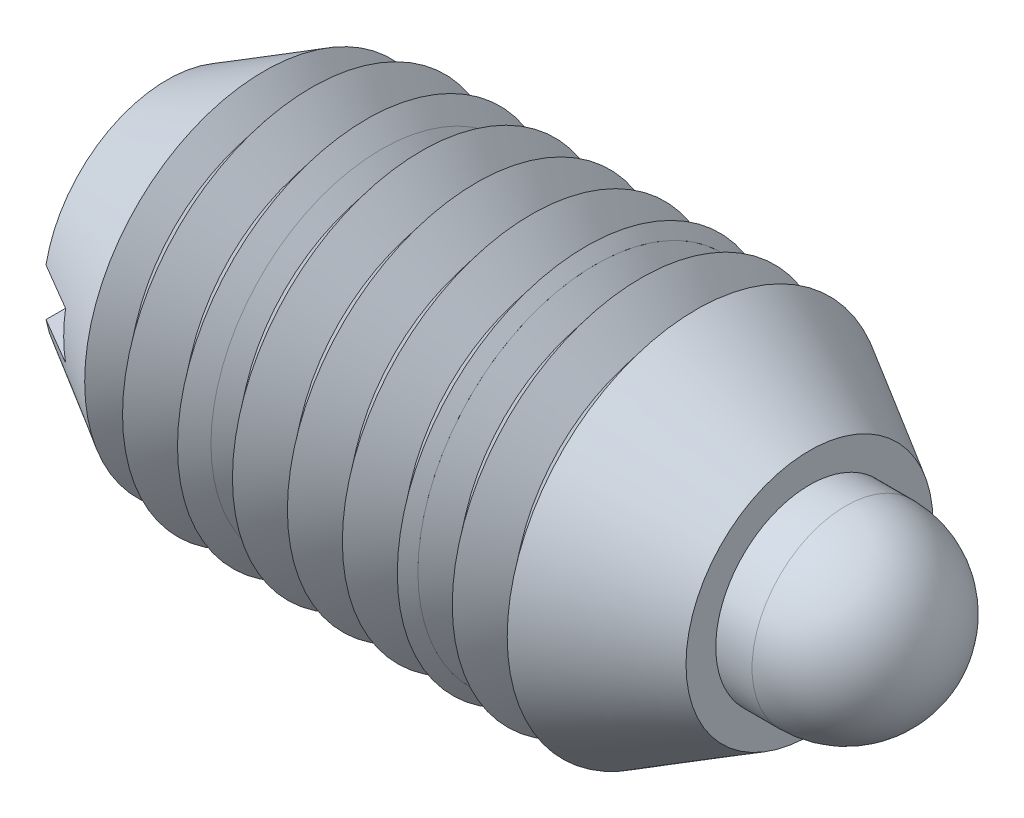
ISO-10303-21;
HEADER;
FILE_DESCRIPTION(('STEP AP214'),'2;1');
FILE_NAME('part.step','',(''),(''),'','','');
FILE_SCHEMA(('AUTOMOTIVE_DESIGN { 1 0 10303 214 1 1 1 1 }'));
ENDSEC;
DATA;
#1=APPLICATION_CONTEXT('core data for automotive mechanical design processes');
#2=APPLICATION_PROTOCOL_DEFINITION('international standard','automotive_design',2000,#1);
#3=PRODUCT_CONTEXT('',#1,'mechanical');
#4=PRODUCT('Part','Part','',(#3));
#5=PRODUCT_RELATED_PRODUCT_CATEGORY('part','',(#4));
#6=PRODUCT_DEFINITION_FORMATION('','',#4);
#7=PRODUCT_DEFINITION_CONTEXT('part definition',#1,'design');
#8=PRODUCT_DEFINITION('design','',#6,#7);
#9=PRODUCT_DEFINITION_SHAPE('','',#8);
#10=(LENGTH_UNIT() NAMED_UNIT(*) SI_UNIT(.MILLI.,.METRE.));
#11=(NAMED_UNIT(*) PLANE_ANGLE_UNIT() SI_UNIT($,.RADIAN.));
#12=(NAMED_UNIT(*) SI_UNIT($,.STERADIAN.) SOLID_ANGLE_UNIT());
#13=UNCERTAINTY_MEASURE_WITH_UNIT(LENGTH_MEASURE(1.E-05),#10,'distance_accuracy_value','');
#14=(GEOMETRIC_REPRESENTATION_CONTEXT(3) GLOBAL_UNCERTAINTY_ASSIGNED_CONTEXT((#13)) GLOBAL_UNIT_ASSIGNED_CONTEXT((#10,
#11,#12)) REPRESENTATION_CONTEXT('',''));
#15=CARTESIAN_POINT('',(0.,0.,0.));
#16=DIRECTION('',(0.,0.,1.));
#17=DIRECTION('',(1.,0.,0.));
#18=AXIS2_PLACEMENT_3D('',#15,#16,#17);
#19=CARTESIAN_POINT('',(17.9324,0.,0.));
#20=DIRECTION('',(-1.,0.,0.));
#21=DIRECTION('',(0.,-0.719424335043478,-0.694570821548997));
#22=AXIS2_PLACEMENT_3D('',#19,#20,#21);
#23=PLANE('',#22);
#24=CARTESIAN_POINT('',(17.9324,0.,0.));
#25=DIRECTION('',(1.,0.,0.));
#26=DIRECTION('',(0.,0.719424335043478,0.694570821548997));
#27=AXIS2_PLACEMENT_3D('',#24,#25,#26);
#28=CIRCLE('',#27,3.937);
#29=CARTESIAN_POINT('',(17.9324,2.83237360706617,2.7345253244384));
#30=VERTEX_POINT('',#29);
#31=EDGE_CURVE('P0_E10',#30,#30,#28,.T.);
#32=ORIENTED_EDGE('',*,*,#31,.F.);
#33=EDGE_LOOP('',(#32));
#34=FACE_BOUND('',#33,.T.);
#35=ADVANCED_FACE('P0_F14',(#34),#23,.T.);
#36=CARTESIAN_POINT('',(18.7198,0.,0.));
#37=DIRECTION('',(1.,0.,0.));
#38=DIRECTION('',(0.,0.719424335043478,0.694570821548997));
#39=AXIS2_PLACEMENT_3D('',#36,#37,#38);
#40=CONICAL_SURFACE('',#39,4.7244,0.78539816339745);
#41=ORIENTED_EDGE('',*,*,#31,.T.);
#42=EDGE_LOOP('',(#41));
#43=FACE_BOUND('',#42,.T.);
#44=CARTESIAN_POINT('',(18.7198,0.,0.));
#45=DIRECTION('',(1.,0.,0.));
#46=DIRECTION('',(0.,0.719424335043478,0.694570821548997));
#47=AXIS2_PLACEMENT_3D('',#44,#45,#46);
#48=CIRCLE('',#47,4.7244);
#49=CARTESIAN_POINT('',(18.7198,3.39884832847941,3.28143038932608));
#50=VERTEX_POINT('',#49);
#51=EDGE_CURVE('P0_E20',#50,#50,#48,.T.);
#52=ORIENTED_EDGE('',*,*,#51,.F.);
#53=EDGE_LOOP('',(#52));
#54=FACE_BOUND('',#53,.T.);
#55=ADVANCED_FACE('P0_F54',(#43,#54),#40,.T.);
#56=CARTESIAN_POINT('',(32.4485,0.,0.));
#57=DIRECTION('',(1.,0.,0.));
#58=DIRECTION('',(0.,0.719424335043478,0.694570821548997));
#59=AXIS2_PLACEMENT_3D('',#56,#57,#58);
#60=CYLINDRICAL_SURFACE('',#59,4.7244);
#61=ORIENTED_EDGE('',*,*,#51,.T.);
#62=EDGE_LOOP('',(#61));
#63=FACE_BOUND('',#62,.T.);
#64=CARTESIAN_POINT('',(24.4425831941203,0.,0.));
#65=DIRECTION('',(1.,0.,0.));
#66=DIRECTION('',(0.,0.719424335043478,0.694570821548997));
#67=AXIS2_PLACEMENT_3D('',#64,#65,#66);
#68=CIRCLE('',#67,4.7244);
#69=CARTESIAN_POINT('',(24.4425831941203,3.39884832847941,3.28143038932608));
#70=VERTEX_POINT('',#69);
#71=EDGE_CURVE('P0_E24',#70,#70,#68,.T.);
#72=ORIENTED_EDGE('',*,*,#71,.F.);
#73=EDGE_LOOP('',(#72));
#74=FACE_BOUND('',#73,.T.);
#75=ADVANCED_FACE('P0_F50',(#63,#74),#60,.T.);
#76=CARTESIAN_POINT('',(25.8064,0.,0.));
#77=DIRECTION('',(-1.,0.,0.));
#78=DIRECTION('',(0.,-0.719424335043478,-0.694570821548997));
#79=AXIS2_PLACEMENT_3D('',#76,#77,#78);
#80=CONICAL_SURFACE('',#79,3.937,0.523598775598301);
#81=ORIENTED_EDGE('',*,*,#71,.T.);
#82=EDGE_LOOP('',(#81));
#83=FACE_BOUND('',#82,.T.);
#84=CARTESIAN_POINT('',(25.8064,0.,0.));
#85=DIRECTION('',(1.,0.,0.));
#86=DIRECTION('',(0.,0.719424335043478,0.694570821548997));
#87=AXIS2_PLACEMENT_3D('',#84,#85,#86);
#88=CIRCLE('',#87,3.937);
#89=CARTESIAN_POINT('',(25.8064,2.83237360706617,2.7345253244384));
#90=VERTEX_POINT('',#89);
#91=EDGE_CURVE('P0_E28',#90,#90,#88,.T.);
#92=ORIENTED_EDGE('',*,*,#91,.F.);
#93=EDGE_LOOP('',(#92));
#94=FACE_BOUND('',#93,.T.);
#95=ADVANCED_FACE('P0_F41',(#83,#94),#80,.T.);
#96=CARTESIAN_POINT('',(32.4485,0.,0.));
#97=DIRECTION('',(1.,0.,0.));
#98=DIRECTION('',(0.,0.719424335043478,0.694570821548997));
#99=AXIS2_PLACEMENT_3D('',#96,#97,#98);
#100=CYLINDRICAL_SURFACE('',#99,3.937);
#101=ORIENTED_EDGE('',*,*,#91,.T.);
#102=EDGE_LOOP('',(#101));
#103=FACE_BOUND('',#102,.T.);
#104=CARTESIAN_POINT('',(28.5115,0.,0.));
#105=DIRECTION('',(1.,0.,0.));
#106=DIRECTION('',(0.,0.719424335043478,0.694570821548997));
#107=AXIS2_PLACEMENT_3D('',#104,#105,#106);
#108=CIRCLE('',#107,3.937);
#109=CARTESIAN_POINT('',(28.5115,2.83237360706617,2.7345253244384));
#110=VERTEX_POINT('',#109);
#111=EDGE_CURVE('P0_E33',#110,#110,#108,.T.);
#112=ORIENTED_EDGE('',*,*,#111,.F.);
#113=EDGE_LOOP('',(#112));
#114=FACE_BOUND('',#113,.T.);
#115=ADVANCED_FACE('P0_F39',(#103,#114),#100,.T.);
#116=CARTESIAN_POINT('',(28.5115,0.,0.));
#117=DIRECTION('',(1.,0.,0.));
#118=DIRECTION('',(0.,0.719424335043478,0.694570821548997));
#119=AXIS2_PLACEMENT_3D('',#116,#117,#118);
#120=SPHERICAL_SURFACE('',#119,3.937);
#121=ORIENTED_EDGE('',*,*,#111,.T.);
#122=EDGE_LOOP('',(#121));
#123=FACE_BOUND('',#122,.T.);
#124=ADVANCED_FACE('P0_F37',(#123),#120,.T.);
#125=CLOSED_SHELL('',(#35,#55,#75,#95,#115,#124));
#126=MANIFOLD_SOLID_BREP('P0_B1',#125);
#127=CARTESIAN_POINT('',(8.99583333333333,15.875,-7.9375));
#128=DIRECTION('',(-1.,0.,0.));
#129=DIRECTION('',(0.,-1.,0.));
#130=AXIS2_PLACEMENT_3D('',#127,#128,#129);
#131=PLANE('',#130);
#132=CARTESIAN_POINT('',(8.99583333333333,0.,0.));
#133=DIRECTION('',(-1.,0.,0.));
#134=DIRECTION('',(0.,-1.,0.));
#135=AXIS2_PLACEMENT_3D('',#132,#133,#134);
#136=CIRCLE('',#135,7.15640214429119);
#137=CARTESIAN_POINT('',(8.99583333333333,-7.15640214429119,0.));
#138=VERTEX_POINT('',#137);
#139=EDGE_CURVE('P1_E31',#138,#138,#136,.F.);
#140=ORIENTED_EDGE('',*,*,#139,.F.);
#141=EDGE_LOOP('',(#140));
#142=FACE_BOUND('',#141,.T.);
#143=CARTESIAN_POINT('',(8.99583333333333,0.,0.));
#144=DIRECTION('',(1.,0.,0.));
#145=DIRECTION('',(0.,0.,-1.));
#146=AXIS2_PLACEMENT_3D('',#143,#144,#145);
#147=CIRCLE('',#146,4.7498);
#148=CARTESIAN_POINT('',(8.99583333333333,0.,-4.7498));
#149=VERTEX_POINT('',#148);
#150=EDGE_CURVE('P1_E47',#149,#149,#147,.T.);
#151=ORIENTED_EDGE('',*,*,#150,.T.);
#152=EDGE_LOOP('',(#151));
#153=FACE_BOUND('',#152,.T.);
#154=ADVANCED_FACE('P1_F14',(#142,#153),#131,.T.);
#155=CARTESIAN_POINT('',(17.9916666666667,15.875,-7.9375));
#156=DIRECTION('',(1.,0.,0.));
#157=DIRECTION('',(0.,1.,0.));
#158=AXIS2_PLACEMENT_3D('',#155,#156,#157);
#159=PLANE('',#158);
#160=CARTESIAN_POINT('',(17.9916666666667,0.,0.));
#161=DIRECTION('',(1.,0.,0.));
#162=DIRECTION('',(0.,1.,0.));
#163=AXIS2_PLACEMENT_3D('',#160,#161,#162);
#164=CIRCLE('',#163,7.45682439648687);
#165=CARTESIAN_POINT('',(17.9916666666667,7.45682439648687,0.));
#166=VERTEX_POINT('',#165);
#167=EDGE_CURVE('P1_E33',#166,#166,#164,.F.);
#168=ORIENTED_EDGE('',*,*,#167,.F.);
#169=EDGE_LOOP('',(#168));
#170=FACE_BOUND('',#169,.T.);
#171=CARTESIAN_POINT('',(17.9916666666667,0.,0.));
#172=DIRECTION('',(1.,0.,0.));
#173=DIRECTION('',(0.,1.,0.));
#174=AXIS2_PLACEMENT_3D('',#171,#172,#173);
#175=CIRCLE('',#174,4.7498);
#176=CARTESIAN_POINT('',(17.9916666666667,4.7498,0.));
#177=VERTEX_POINT('',#176);
#178=EDGE_CURVE('P1_E18',#177,#177,#175,.F.);
#179=ORIENTED_EDGE('',*,*,#178,.T.);
#180=EDGE_LOOP('',(#179));
#181=FACE_BOUND('',#180,.T.);
#182=ADVANCED_FACE('P1_F65',(#170,#181),#159,.T.);
#183=CARTESIAN_POINT('',(14.1431818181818,0.,0.));
#184=DIRECTION('',(1.,0.,0.));
#185=DIRECTION('',(0.,0.,-1.));
#186=AXIS2_PLACEMENT_3D('',#183,#184,#185);
#187=CONICAL_SURFACE('',#186,6.49547318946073,0.895664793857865);
#188=CARTESIAN_POINT('',(15.2977272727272,0.,0.));
#189=DIRECTION('',(-1.,0.,0.));
#190=DIRECTION('',(0.,0.,1.));
#191=AXIS2_PLACEMENT_3D('',#188,#189,#190);
#192=CIRCLE('',#191,7.9375);
#193=CARTESIAN_POINT('',(15.2977272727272,0.,7.9375));
#194=VERTEX_POINT('',#193);
#195=EDGE_CURVE('P1_E54',#194,#194,#192,.T.);
#196=ORIENTED_EDGE('',*,*,#195,.T.);
#197=EDGE_LOOP('',(#196));
#198=FACE_BOUND('',#197,.T.);
#199=CARTESIAN_POINT('',(14.1431818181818,0.,0.));
#200=DIRECTION('',(-1.,0.,0.));
#201=DIRECTION('',(0.,0.,1.));
#202=AXIS2_PLACEMENT_3D('',#199,#200,#201);
#203=CIRCLE('',#202,6.49547318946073);
#204=CARTESIAN_POINT('',(14.1431818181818,0.,6.49547318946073));
#205=VERTEX_POINT('',#204);
#206=EDGE_CURVE('P1_E27',#205,#205,#203,.T.);
#207=ORIENTED_EDGE('',*,*,#206,.F.);
#208=EDGE_LOOP('',(#207));
#209=FACE_BOUND('',#208,.T.);
#210=ADVANCED_FACE('P1_F62',(#198,#209),#187,.T.);
#211=CARTESIAN_POINT('',(15.2977272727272,0.,0.));
#212=DIRECTION('',(-1.,0.,0.));
#213=DIRECTION('',(0.,0.,1.));
#214=AXIS2_PLACEMENT_3D('',#211,#212,#213);
#215=CONICAL_SURFACE('',#214,7.9375,0.895664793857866);
#216=CARTESIAN_POINT('',(16.4522727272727,0.,0.));
#217=DIRECTION('',(-1.,0.,0.));
#218=DIRECTION('',(0.,0.,1.));
#219=AXIS2_PLACEMENT_3D('',#216,#217,#218);
#220=CIRCLE('',#219,6.49547318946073);
#221=CARTESIAN_POINT('',(16.4522727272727,0.,6.49547318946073));
#222=VERTEX_POINT('',#221);
#223=EDGE_CURVE('P1_E10',#222,#222,#220,.T.);
#224=ORIENTED_EDGE('',*,*,#223,.T.);
#225=EDGE_LOOP('',(#224));
#226=FACE_BOUND('',#225,.T.);
#227=ORIENTED_EDGE('',*,*,#195,.F.);
#228=EDGE_LOOP('',(#227));
#229=FACE_BOUND('',#228,.T.);
#230=ADVANCED_FACE('P1_F64',(#226,#229),#215,.T.);
#231=CARTESIAN_POINT('',(16.4522727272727,0.,0.));
#232=DIRECTION('',(1.,0.,0.));
#233=DIRECTION('',(0.,0.,-1.));
#234=AXIS2_PLACEMENT_3D('',#231,#232,#233);
#235=CONICAL_SURFACE('',#234,6.49547318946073,0.895664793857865);
#236=CARTESIAN_POINT('',(17.6068181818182,0.,0.));
#237=DIRECTION('',(-1.,0.,0.));
#238=DIRECTION('',(0.,0.,1.));
#239=AXIS2_PLACEMENT_3D('',#236,#237,#238);
#240=CIRCLE('',#239,7.9375);
#241=CARTESIAN_POINT('',(17.6068181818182,0.,7.9375));
#242=VERTEX_POINT('',#241);
#243=EDGE_CURVE('P1_E22',#242,#242,#240,.T.);
#244=ORIENTED_EDGE('',*,*,#243,.T.);
#245=EDGE_LOOP('',(#244));
#246=FACE_BOUND('',#245,.T.);
#247=ORIENTED_EDGE('',*,*,#223,.F.);
#248=EDGE_LOOP('',(#247));
#249=FACE_BOUND('',#248,.T.);
#250=ADVANCED_FACE('P1_F73',(#246,#249),#235,.T.);
#251=CARTESIAN_POINT('',(17.6068181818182,0.,0.));
#252=DIRECTION('',(-1.,0.,0.));
#253=DIRECTION('',(0.,0.,1.));
#254=AXIS2_PLACEMENT_3D('',#251,#252,#253);
#255=CONICAL_SURFACE('',#254,7.9375,0.895664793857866);
#256=ORIENTED_EDGE('',*,*,#243,.F.);
#257=EDGE_LOOP('',(#256));
#258=FACE_BOUND('',#257,.T.);
#259=ORIENTED_EDGE('',*,*,#167,.T.);
#260=EDGE_LOOP('',(#259));
#261=FACE_BOUND('',#260,.T.);
#262=ADVANCED_FACE('P1_F16',(#258,#261),#255,.T.);
#263=CARTESIAN_POINT('',(12.9886363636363,0.,0.));
#264=DIRECTION('',(-1.,0.,0.));
#265=DIRECTION('',(0.,0.,1.));
#266=AXIS2_PLACEMENT_3D('',#263,#264,#265);
#267=CONICAL_SURFACE('',#266,7.9375,0.895664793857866);
#268=ORIENTED_EDGE('',*,*,#206,.T.);
#269=EDGE_LOOP('',(#268));
#270=FACE_BOUND('',#269,.T.);
#271=CARTESIAN_POINT('',(12.9886363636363,0.,0.));
#272=DIRECTION('',(-1.,0.,0.));
#273=DIRECTION('',(0.,0.,1.));
#274=AXIS2_PLACEMENT_3D('',#271,#272,#273);
#275=CIRCLE('',#274,7.9375);
#276=CARTESIAN_POINT('',(12.9886363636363,0.,7.9375));
#277=VERTEX_POINT('',#276);
#278=EDGE_CURVE('P1_E44',#277,#277,#275,.T.);
#279=ORIENTED_EDGE('',*,*,#278,.F.);
#280=EDGE_LOOP('',(#279));
#281=FACE_BOUND('',#280,.T.);
#282=ADVANCED_FACE('P1_F59',(#270,#281),#267,.T.);
#283=CARTESIAN_POINT('',(11.8340909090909,0.,0.));
#284=DIRECTION('',(1.,0.,0.));
#285=DIRECTION('',(0.,0.,-1.));
#286=AXIS2_PLACEMENT_3D('',#283,#284,#285);
#287=CONICAL_SURFACE('',#286,6.49547318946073,0.895664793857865);
#288=ORIENTED_EDGE('',*,*,#278,.T.);
#289=EDGE_LOOP('',(#288));
#290=FACE_BOUND('',#289,.T.);
#291=CARTESIAN_POINT('',(11.8340909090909,0.,0.));
#292=DIRECTION('',(-1.,0.,0.));
#293=DIRECTION('',(0.,0.,1.));
#294=AXIS2_PLACEMENT_3D('',#291,#292,#293);
#295=CIRCLE('',#294,6.49547318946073);
#296=CARTESIAN_POINT('',(11.8340909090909,0.,6.49547318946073));
#297=VERTEX_POINT('',#296);
#298=EDGE_CURVE('P1_E51',#297,#297,#295,.T.);
#299=ORIENTED_EDGE('',*,*,#298,.F.);
#300=EDGE_LOOP('',(#299));
#301=FACE_BOUND('',#300,.T.);
#302=ADVANCED_FACE('P1_F98',(#290,#301),#287,.T.);
#303=CARTESIAN_POINT('',(10.6795454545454,0.,0.));
#304=DIRECTION('',(-1.,0.,0.));
#305=DIRECTION('',(0.,0.,1.));
#306=AXIS2_PLACEMENT_3D('',#303,#304,#305);
#307=CONICAL_SURFACE('',#306,7.9375,0.895664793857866);
#308=ORIENTED_EDGE('',*,*,#298,.T.);
#309=EDGE_LOOP('',(#308));
#310=FACE_BOUND('',#309,.T.);
#311=CARTESIAN_POINT('',(10.6795454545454,0.,0.));
#312=DIRECTION('',(-1.,0.,0.));
#313=DIRECTION('',(0.,0.,1.));
#314=AXIS2_PLACEMENT_3D('',#311,#312,#313);
#315=CIRCLE('',#314,7.9375);
#316=CARTESIAN_POINT('',(10.6795454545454,0.,7.9375));
#317=VERTEX_POINT('',#316);
#318=EDGE_CURVE('P1_E35',#317,#317,#315,.T.);
#319=ORIENTED_EDGE('',*,*,#318,.F.);
#320=EDGE_LOOP('',(#319));
#321=FACE_BOUND('',#320,.T.);
#322=ADVANCED_FACE('P1_F95',(#310,#321),#307,.T.);
#323=CARTESIAN_POINT('',(9.52499999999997,0.,0.));
#324=DIRECTION('',(1.,0.,0.));
#325=DIRECTION('',(0.,0.,-1.));
#326=AXIS2_PLACEMENT_3D('',#323,#324,#325);
#327=CONICAL_SURFACE('',#326,6.49547318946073,0.895664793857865);
#328=ORIENTED_EDGE('',*,*,#318,.T.);
#329=EDGE_LOOP('',(#328));
#330=FACE_BOUND('',#329,.T.);
#331=CARTESIAN_POINT('',(9.52499999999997,0.,0.));
#332=DIRECTION('',(-1.,0.,0.));
#333=DIRECTION('',(0.,0.,1.));
#334=AXIS2_PLACEMENT_3D('',#331,#332,#333);
#335=CIRCLE('',#334,6.49547318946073);
#336=CARTESIAN_POINT('',(9.52499999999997,0.,6.49547318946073));
#337=VERTEX_POINT('',#336);
#338=EDGE_CURVE('P1_E39',#337,#337,#335,.T.);
#339=ORIENTED_EDGE('',*,*,#338,.F.);
#340=EDGE_LOOP('',(#339));
#341=FACE_BOUND('',#340,.T.);
#342=ADVANCED_FACE('P1_F91',(#330,#341),#327,.T.);
#343=CARTESIAN_POINT('',(8.37045454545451,0.,0.));
#344=DIRECTION('',(-1.,0.,0.));
#345=DIRECTION('',(0.,0.,1.));
#346=AXIS2_PLACEMENT_3D('',#343,#344,#345);
#347=CONICAL_SURFACE('',#346,7.9375,0.895664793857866);
#348=ORIENTED_EDGE('',*,*,#338,.T.);
#349=EDGE_LOOP('',(#348));
#350=FACE_BOUND('',#349,.T.);
#351=ORIENTED_EDGE('',*,*,#139,.T.);
#352=EDGE_LOOP('',(#351));
#353=FACE_BOUND('',#352,.T.);
#354=ADVANCED_FACE('P1_F87',(#350,#353),#347,.T.);
#355=CARTESIAN_POINT('',(26.9875,0.,0.));
#356=DIRECTION('',(-1.,0.,0.));
#357=DIRECTION('',(0.,0.,1.));
#358=AXIS2_PLACEMENT_3D('',#355,#356,#357);
#359=CYLINDRICAL_SURFACE('',#358,4.7498);
#360=ORIENTED_EDGE('',*,*,#178,.F.);
#361=EDGE_LOOP('',(#360));
#362=FACE_BOUND('',#361,.T.);
#363=ORIENTED_EDGE('',*,*,#150,.F.);
#364=EDGE_LOOP('',(#363));
#365=FACE_BOUND('',#364,.T.);
#366=ADVANCED_FACE('P1_F90',(#362,#365),#359,.F.);
#367=CLOSED_SHELL('',(#154,#182,#210,#230,#250,#262,#282,#302,#322,#342,#354,#366));
#368=MANIFOLD_SOLID_BREP('P1_B1',#367);
#369=CARTESIAN_POINT('',(26.9875,0.,0.));
#370=DIRECTION('',(1.,0.,0.));
#371=DIRECTION('',(0.,0.,-1.));
#372=AXIS2_PLACEMENT_3D('',#369,#370,#371);
#373=PLANE('',#372);
#374=CARTESIAN_POINT('',(26.9875,0.,0.));
#375=DIRECTION('',(1.,0.,0.));
#376=DIRECTION('',(0.,0.,-1.));
#377=AXIS2_PLACEMENT_3D('',#374,#375,#376);
#378=CIRCLE('',#377,5.18786934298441);
#379=CARTESIAN_POINT('',(26.9875,0.,-5.18786934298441));
#380=VERTEX_POINT('',#379);
#381=EDGE_CURVE('P2_E79',#380,#380,#378,.T.);
#382=ORIENTED_EDGE('',*,*,#381,.T.);
#383=EDGE_LOOP('',(#382));
#384=FACE_BOUND('',#383,.T.);
#385=CARTESIAN_POINT('',(26.9875,0.,0.));
#386=DIRECTION('',(-1.,0.,0.));
#387=DIRECTION('',(0.,0.,1.));
#388=AXIS2_PLACEMENT_3D('',#385,#386,#387);
#389=CIRCLE('',#388,3.937);
#390=CARTESIAN_POINT('',(26.9875,0.,3.937));
#391=VERTEX_POINT('',#390);
#392=EDGE_CURVE('P2_E66',#391,#391,#389,.T.);
#393=ORIENTED_EDGE('',*,*,#392,.T.);
#394=EDGE_LOOP('',(#393));
#395=FACE_BOUND('',#394,.T.);
#396=ADVANCED_FACE('P2_F15',(#384,#395),#373,.T.);
#397=CARTESIAN_POINT('',(26.9875,0.,0.));
#398=DIRECTION('',(-1.,0.,0.));
#399=DIRECTION('',(0.,0.,1.));
#400=AXIS2_PLACEMENT_3D('',#397,#398,#399);
#401=CONICAL_SURFACE('',#400,5.18786934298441,0.523598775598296);
#402=CARTESIAN_POINT('',(22.225,0.,0.));
#403=DIRECTION('',(-1.,0.,0.));
#404=DIRECTION('',(0.,0.,1.));
#405=AXIS2_PLACEMENT_3D('',#402,#403,#404);
#406=CIRCLE('',#405,7.9375);
#407=CARTESIAN_POINT('',(22.225,0.,7.9375));
#408=VERTEX_POINT('',#407);
#409=EDGE_CURVE('P2_E144',#408,#408,#406,.T.);
#410=ORIENTED_EDGE('',*,*,#409,.F.);
#411=EDGE_LOOP('',(#410));
#412=FACE_BOUND('',#411,.T.);
#413=ORIENTED_EDGE('',*,*,#381,.F.);
#414=EDGE_LOOP('',(#413));
#415=FACE_BOUND('',#414,.T.);
#416=ADVANCED_FACE('P2_F17',(#412,#415),#401,.T.);
#417=CARTESIAN_POINT('',(0.,0.,0.));
#418=DIRECTION('',(-1.,0.,0.));
#419=DIRECTION('',(0.,0.,1.));
#420=AXIS2_PLACEMENT_3D('',#417,#418,#419);
#421=CYLINDRICAL_SURFACE('',#420,3.937);
#422=CARTESIAN_POINT('',(25.8064,0.,0.));
#423=DIRECTION('',(-1.,0.,0.));
#424=DIRECTION('',(0.,0.,1.));
#425=AXIS2_PLACEMENT_3D('',#422,#423,#424);
#426=CIRCLE('',#425,3.937);
#427=CARTESIAN_POINT('',(25.8064,0.,3.937));
#428=VERTEX_POINT('',#427);
#429=EDGE_CURVE('P2_E156',#428,#428,#426,.T.);
#430=ORIENTED_EDGE('',*,*,#429,.T.);
#431=EDGE_LOOP('',(#430));
#432=FACE_BOUND('',#431,.T.);
#433=ORIENTED_EDGE('',*,*,#392,.F.);
#434=EDGE_LOOP('',(#433));
#435=FACE_BOUND('',#434,.T.);
#436=ADVANCED_FACE('P2_F179',(#432,#435),#421,.F.);
#437=CARTESIAN_POINT('',(25.8064,0.,0.));
#438=DIRECTION('',(-1.,0.,0.));
#439=DIRECTION('',(0.,0.,1.));
#440=AXIS2_PLACEMENT_3D('',#437,#438,#439);
#441=CONICAL_SURFACE('',#440,3.937,0.785398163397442);
#442=CARTESIAN_POINT('',(25.019,0.,0.));
#443=DIRECTION('',(-1.,0.,0.));
#444=DIRECTION('',(0.,0.,1.));
#445=AXIS2_PLACEMENT_3D('',#442,#443,#444);
#446=CIRCLE('',#445,4.7244);
#447=CARTESIAN_POINT('',(25.019,0.,4.7244));
#448=VERTEX_POINT('',#447);
#449=EDGE_CURVE('P2_E153',#448,#448,#446,.T.);
#450=ORIENTED_EDGE('',*,*,#449,.T.);
#451=EDGE_LOOP('',(#450));
#452=FACE_BOUND('',#451,.T.);
#453=ORIENTED_EDGE('',*,*,#429,.F.);
#454=EDGE_LOOP('',(#453));
#455=FACE_BOUND('',#454,.T.);
#456=ADVANCED_FACE('P2_F186',(#452,#455),#441,.F.);
#457=CARTESIAN_POINT('',(0.,0.,0.));
#458=DIRECTION('',(-1.,0.,0.));
#459=DIRECTION('',(0.,0.,1.));
#460=AXIS2_PLACEMENT_3D('',#457,#458,#459);
#461=CYLINDRICAL_SURFACE('',#460,4.7244);
#462=CARTESIAN_POINT('',(5.953125,0.,0.));
#463=DIRECTION('',(-1.,0.,0.));
#464=DIRECTION('',(0.,0.,1.));
#465=AXIS2_PLACEMENT_3D('',#462,#463,#464);
#466=CIRCLE('',#465,4.7244);
#467=CARTESIAN_POINT('',(5.953125,0.,4.7244));
#468=VERTEX_POINT('',#467);
#469=EDGE_CURVE('P2_E150',#468,#468,#466,.T.);
#470=ORIENTED_EDGE('',*,*,#469,.T.);
#471=EDGE_LOOP('',(#470));
#472=FACE_BOUND('',#471,.T.);
#473=ORIENTED_EDGE('',*,*,#449,.F.);
#474=EDGE_LOOP('',(#473));
#475=FACE_BOUND('',#474,.T.);
#476=ADVANCED_FACE('P2_F191',(#472,#475),#461,.F.);
#477=CARTESIAN_POINT('',(5.953125,0.,0.));
#478=DIRECTION('',(1.,0.,0.));
#479=DIRECTION('',(0.,0.,-1.));
#480=AXIS2_PLACEMENT_3D('',#477,#478,#479);
#481=PLANE('',#480);
#482=ORIENTED_EDGE('',*,*,#469,.F.);
#483=EDGE_LOOP('',(#482));
#484=FACE_BOUND('',#483,.T.);
#485=ADVANCED_FACE('P2_F197',(#484),#481,.T.);
#486=CARTESIAN_POINT('',(21.0704545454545,0.,0.));
#487=DIRECTION('',(1.,0.,0.));
#488=DIRECTION('',(0.,0.,-1.));
#489=AXIS2_PLACEMENT_3D('',#486,#487,#488);
#490=CONICAL_SURFACE('',#489,6.49547318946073,0.895664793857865);
#491=ORIENTED_EDGE('',*,*,#409,.T.);
#492=EDGE_LOOP('',(#491));
#493=FACE_BOUND('',#492,.T.);
#494=CARTESIAN_POINT('',(21.0704545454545,0.,0.));
#495=DIRECTION('',(-1.,0.,0.));
#496=DIRECTION('',(0.,0.,1.));
#497=AXIS2_PLACEMENT_3D('',#494,#495,#496);
#498=CIRCLE('',#497,6.49547318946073);
#499=CARTESIAN_POINT('',(21.0704545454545,0.,6.49547318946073));
#500=VERTEX_POINT('',#499);
#501=EDGE_CURVE('P2_E147',#500,#500,#498,.T.);
#502=ORIENTED_EDGE('',*,*,#501,.F.);
#503=EDGE_LOOP('',(#502));
#504=FACE_BOUND('',#503,.T.);
#505=ADVANCED_FACE('P2_F201',(#493,#504),#490,.T.);
#506=CARTESIAN_POINT('',(19.9159090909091,0.,0.));
#507=DIRECTION('',(-1.,0.,0.));
#508=DIRECTION('',(0.,0.,1.));
#509=AXIS2_PLACEMENT_3D('',#506,#507,#508);
#510=CONICAL_SURFACE('',#509,7.9375,0.895664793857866);
#511=ORIENTED_EDGE('',*,*,#501,.T.);
#512=EDGE_LOOP('',(#511));
#513=FACE_BOUND('',#512,.T.);
#514=CARTESIAN_POINT('',(19.9159090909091,0.,0.));
#515=DIRECTION('',(-1.,0.,0.));
#516=DIRECTION('',(0.,0.,1.));
#517=AXIS2_PLACEMENT_3D('',#514,#515,#516);
#518=CIRCLE('',#517,7.9375);
#519=CARTESIAN_POINT('',(19.9159090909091,0.,7.9375));
#520=VERTEX_POINT('',#519);
#521=EDGE_CURVE('P2_E138',#520,#520,#518,.T.);
#522=ORIENTED_EDGE('',*,*,#521,.F.);
#523=EDGE_LOOP('',(#522));
#524=FACE_BOUND('',#523,.T.);
#525=ADVANCED_FACE('P2_F205',(#513,#524),#510,.T.);
#526=CARTESIAN_POINT('',(18.7613636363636,0.,0.));
#527=DIRECTION('',(1.,0.,0.));
#528=DIRECTION('',(0.,0.,-1.));
#529=AXIS2_PLACEMENT_3D('',#526,#527,#528);
#530=CONICAL_SURFACE('',#529,6.49547318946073,0.895664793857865);
#531=ORIENTED_EDGE('',*,*,#521,.T.);
#532=EDGE_LOOP('',(#531));
#533=FACE_BOUND('',#532,.T.);
#534=CARTESIAN_POINT('',(18.7613636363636,0.,0.));
#535=DIRECTION('',(-1.,0.,0.));
#536=DIRECTION('',(0.,0.,1.));
#537=AXIS2_PLACEMENT_3D('',#534,#535,#536);
#538=CIRCLE('',#537,6.49547318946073);
#539=CARTESIAN_POINT('',(18.7613636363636,0.,6.49547318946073));
#540=VERTEX_POINT('',#539);
#541=EDGE_CURVE('P2_E141',#540,#540,#538,.T.);
#542=ORIENTED_EDGE('',*,*,#541,.F.);
#543=EDGE_LOOP('',(#542));
#544=FACE_BOUND('',#543,.T.);
#545=ADVANCED_FACE('P2_F209',(#533,#544),#530,.T.);
#546=CARTESIAN_POINT('',(17.6068181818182,0.,0.));
#547=DIRECTION('',(-1.,0.,0.));
#548=DIRECTION('',(0.,0.,1.));
#549=AXIS2_PLACEMENT_3D('',#546,#547,#548);
#550=CONICAL_SURFACE('',#549,7.9375,0.895664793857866);
#551=CARTESIAN_POINT('',(17.9916666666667,0.,0.));
#552=DIRECTION('',(1.,0.,0.));
#553=DIRECTION('',(0.,0.,-1.));
#554=AXIS2_PLACEMENT_3D('',#551,#552,#553);
#555=CIRCLE('',#554,7.45682439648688);
#556=CARTESIAN_POINT('',(17.9916666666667,0.,-7.45682439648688));
#557=VERTEX_POINT('',#556);
#558=EDGE_CURVE('P2_E19',#557,#557,#555,.F.);
#559=ORIENTED_EDGE('',*,*,#558,.F.);
#560=EDGE_LOOP('',(#559));
#561=FACE_BOUND('',#560,.T.);
#562=ORIENTED_EDGE('',*,*,#541,.T.);
#563=EDGE_LOOP('',(#562));
#564=FACE_BOUND('',#563,.T.);
#565=ADVANCED_FACE('P2_F213',(#561,#564),#550,.T.);
#566=CARTESIAN_POINT('',(8.99583333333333,0.,0.));
#567=DIRECTION('',(1.,0.,0.));
#568=DIRECTION('',(0.,0.,-1.));
#569=AXIS2_PLACEMENT_3D('',#566,#567,#568);
#570=PLANE('',#569);
#571=CARTESIAN_POINT('',(8.99583333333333,0.,0.));
#572=DIRECTION('',(1.,0.,0.));
#573=DIRECTION('',(0.,0.,-1.));
#574=AXIS2_PLACEMENT_3D('',#571,#572,#573);
#575=CIRCLE('',#574,7.15640214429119);
#576=CARTESIAN_POINT('',(8.99583333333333,0.,-7.15640214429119));
#577=VERTEX_POINT('',#576);
#578=EDGE_CURVE('P2_E114',#577,#577,#575,.F.);
#579=ORIENTED_EDGE('',*,*,#578,.F.);
#580=EDGE_LOOP('',(#579));
#581=FACE_BOUND('',#580,.T.);
#582=CARTESIAN_POINT('',(8.99583333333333,0.,0.));
#583=DIRECTION('',(1.,0.,0.));
#584=DIRECTION('',(0.,0.,-1.));
#585=AXIS2_PLACEMENT_3D('',#582,#583,#584);
#586=CIRCLE('',#585,4.7498);
#587=CARTESIAN_POINT('',(8.99583333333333,0.,-4.7498));
#588=VERTEX_POINT('',#587);
#589=EDGE_CURVE('P2_E116',#588,#588,#586,.T.);
#590=ORIENTED_EDGE('',*,*,#589,.F.);
#591=EDGE_LOOP('',(#590));
#592=FACE_BOUND('',#591,.T.);
#593=ADVANCED_FACE('P2_F217',(#581,#592),#570,.T.);
#594=CARTESIAN_POINT('',(40.6668133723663,0.,0.));
#595=DIRECTION('',(-1.,0.,0.));
#596=DIRECTION('',(0.,0.,1.));
#597=AXIS2_PLACEMENT_3D('',#594,#595,#596);
#598=CYLINDRICAL_SURFACE('',#597,4.7498);
#599=ORIENTED_EDGE('',*,*,#589,.T.);
#600=EDGE_LOOP('',(#599));
#601=FACE_BOUND('',#600,.T.);
#602=CARTESIAN_POINT('',(17.9916666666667,0.,0.));
#603=DIRECTION('',(1.,0.,0.));
#604=DIRECTION('',(0.,0.,-1.));
#605=AXIS2_PLACEMENT_3D('',#602,#603,#604);
#606=CIRCLE('',#605,4.7498);
#607=CARTESIAN_POINT('',(17.9916666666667,0.,-4.7498));
#608=VERTEX_POINT('',#607);
#609=EDGE_CURVE('P2_E122',#608,#608,#606,.T.);
#610=ORIENTED_EDGE('',*,*,#609,.F.);
#611=EDGE_LOOP('',(#610));
#612=FACE_BOUND('',#611,.T.);
#613=ADVANCED_FACE('P2_F170',(#601,#612),#598,.T.);
#614=CARTESIAN_POINT('',(17.9916666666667,0.,0.));
#615=DIRECTION('',(1.,0.,0.));
#616=DIRECTION('',(0.,0.,-1.));
#617=AXIS2_PLACEMENT_3D('',#614,#615,#616);
#618=PLANE('',#617);
#619=ORIENTED_EDGE('',*,*,#558,.T.);
#620=EDGE_LOOP('',(#619));
#621=FACE_BOUND('',#620,.T.);
#622=ORIENTED_EDGE('',*,*,#609,.T.);
#623=EDGE_LOOP('',(#622));
#624=FACE_BOUND('',#623,.T.);
#625=ADVANCED_FACE('P2_F165',(#621,#624),#618,.F.);
#626=CARTESIAN_POINT('',(0.,0.,0.));
#627=DIRECTION('',(1.,0.,0.));
#628=DIRECTION('',(0.,0.,-1.));
#629=AXIS2_PLACEMENT_3D('',#626,#627,#628);
#630=PLANE('',#629);
#631=CARTESIAN_POINT('',(0.,0.,0.));
#632=DIRECTION('',(1.,0.,0.));
#633=DIRECTION('',(0.,0.,-1.));
#634=AXIS2_PLACEMENT_3D('',#631,#632,#633);
#635=CIRCLE('',#634,5.18786934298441);
#636=CARTESIAN_POINT('',(0.,-0.9921875,-5.09210686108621));
#637=VERTEX_POINT('',#636);
#638=CARTESIAN_POINT('',(0.,-0.9921875,5.09210686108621));
#639=VERTEX_POINT('',#638);
#640=EDGE_CURVE('P2_E75',#637,#639,#635,.F.);
#641=ORIENTED_EDGE('',*,*,#640,.T.);
#642=DIRECTION('',(0.,0.,1.));
#643=VECTOR('',#642,1.);
#644=CARTESIAN_POINT('',(0.,-0.9921875,-7.9375));
#645=LINE('',#644,#643);
#646=EDGE_CURVE('P2_E33',#637,#639,#645,.T.);
#647=ORIENTED_EDGE('',*,*,#646,.F.);
#648=EDGE_LOOP('',(#641,#647));
#649=FACE_BOUND('',#648,.T.);
#650=ADVANCED_FACE('P2_F101',(#649),#630,.F.);
#651=CARTESIAN_POINT('',(0.,-0.9921875,-7.9375));
#652=DIRECTION('',(0.,-1.,0.));
#653=DIRECTION('',(0.,0.,-1.));
#654=AXIS2_PLACEMENT_3D('',#651,#652,#653);
#655=PLANE('',#654);
#656=CARTESIAN_POINT('',(11.583700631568,-0.9921875,-11.8342020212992));
#657=CARTESIAN_POINT('',(11.00534714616,-0.9921875,-11.4991132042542));
#658=CARTESIAN_POINT('',(10.4270328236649,-0.9921875,-11.163956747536));
#659=CARTESIAN_POINT('',(9.27051702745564,-0.9921875,-10.4934477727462));
#660=CARTESIAN_POINT('',(8.69231555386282,-0.9921875,-10.1580952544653));
#661=CARTESIAN_POINT('',(7.53594744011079,-0.9921875,-9.48706806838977));
#662=CARTESIAN_POINT('',(6.95778082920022,-0.9921875,-9.15139335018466));
#663=CARTESIAN_POINT('',(5.80165418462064,-0.9921875,-8.47968948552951));
#664=CARTESIAN_POINT('',(5.22369415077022,-0.9921875,-8.14366033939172));
#665=CARTESIAN_POINT('',(4.08313631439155,-0.9921875,-7.47986391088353));
#666=CARTESIAN_POINT('',(3.52053091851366,-0.9921875,-7.15210968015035));
#667=CARTESIAN_POINT('',(2.39573778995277,-0.9921875,-6.49588187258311));
#668=CARTESIAN_POINT('',(1.83355005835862,-0.9921875,-6.16740829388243));
#669=CARTESIAN_POINT('',(0.709928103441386,-0.9921875,-5.50939435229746));
#670=CARTESIAN_POINT('',(0.148493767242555,-0.9921875,-5.1798541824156));
#671=CARTESIAN_POINT('',(-0.692787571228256,-0.9921875,-4.68406983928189));
#672=CARTESIAN_POINT('',(-0.973069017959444,-0.9921875,-4.51856308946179));
#673=CARTESIAN_POINT('',(-1.53322567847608,-0.9921875,-4.18686356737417));
#674=CARTESIAN_POINT('',(-1.81310089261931,-0.9921875,-4.02067079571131));
#675=CARTESIAN_POINT('',(-2.37380632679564,-0.9921875,-3.68639161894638));
#676=CARTESIAN_POINT('',(-2.65463333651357,-0.9921875,-3.51829982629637));
#677=CARTESIAN_POINT('',(-3.21549865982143,-0.9921875,-3.18058549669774));
#678=CARTESIAN_POINT('',(-3.49553667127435,-0.9921875,-3.01096245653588));
#679=CARTESIAN_POINT('',(-3.91594297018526,-0.9921875,-2.75384833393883));
#680=CARTESIAN_POINT('',(-4.05685597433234,-0.9921875,-2.66724852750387));
#681=CARTESIAN_POINT('',(-4.33817797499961,-0.9921875,-2.49323481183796));
#682=CARTESIAN_POINT('',(-4.47858697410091,-0.9921875,-2.40582090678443));
#683=CARTESIAN_POINT('',(-4.75858088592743,-0.9921875,-2.22997987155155));
#684=CARTESIAN_POINT('',(-4.89816646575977,-0.9921875,-2.14155380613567));
#685=CARTESIAN_POINT('',(-5.17634517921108,-0.9921875,-1.96316452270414));
#686=CARTESIAN_POINT('',(-5.31493835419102,-0.9921875,-1.87320136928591));
#687=CARTESIAN_POINT('',(-5.5907687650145,-0.9921875,-1.69094711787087));
#688=CARTESIAN_POINT('',(-5.72800473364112,-0.9921875,-1.59865408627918));
#689=CARTESIAN_POINT('',(-5.93221385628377,-0.9921875,-1.45741471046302));
#690=CARTESIAN_POINT('',(-6.0001052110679,-0.9921875,-1.40979826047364));
#691=CARTESIAN_POINT('',(-6.13504381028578,-0.9921875,-1.31340466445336));
#692=CARTESIAN_POINT('',(-6.20209119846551,-0.9921875,-1.26462772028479));
#693=CARTESIAN_POINT('',(-6.3343959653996,-0.9921875,-1.16601209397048));
#694=CARTESIAN_POINT('',(-6.39966441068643,-0.9921875,-1.11618834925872));
#695=CARTESIAN_POINT('',(-6.52856900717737,-0.9921875,-1.01448872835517));
#696=CARTESIAN_POINT('',(-6.59220546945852,-0.9921875,-0.962613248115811));
#697=CARTESIAN_POINT('',(-6.71678198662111,-0.9921875,-0.856176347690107));
#698=CARTESIAN_POINT('',(-6.77773221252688,-0.9921875,-0.801627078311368));
#699=CARTESIAN_POINT('',(-6.86607560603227,-0.9921875,-0.716662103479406));
#700=CARTESIAN_POINT('',(-6.89499289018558,-0.9921875,-0.687835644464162));
#701=CARTESIAN_POINT('',(-6.9514583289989,-0.9921875,-0.628877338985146));
#702=CARTESIAN_POINT('',(-6.97900697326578,-0.9921875,-0.598745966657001));
#703=CARTESIAN_POINT('',(-7.02474908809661,-0.9921875,-0.545573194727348));
#704=CARTESIAN_POINT('',(-7.04339424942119,-0.9921875,-0.522921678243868));
#705=CARTESIAN_POINT('',(-7.07945879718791,-0.9921875,-0.476638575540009));
#706=CARTESIAN_POINT('',(-7.09687760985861,-0.9921875,-0.453006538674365));
#707=CARTESIAN_POINT('',(-7.1300632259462,-0.9921875,-0.404711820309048));
#708=CARTESIAN_POINT('',(-7.14583527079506,-0.9921875,-0.380052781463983));
#709=CARTESIAN_POINT('',(-7.17529810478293,-0.9921875,-0.329532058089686));
#710=CARTESIAN_POINT('',(-7.18899026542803,-0.9921875,-0.303671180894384));
#711=CARTESIAN_POINT('',(-7.21654888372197,-0.9921875,-0.244528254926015));
#712=CARTESIAN_POINT('',(-7.22972348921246,-0.9921875,-0.210912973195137));
#713=CARTESIAN_POINT('',(-7.25060813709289,-0.9921875,-0.142014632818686));
#714=CARTESIAN_POINT('',(-7.25832547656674,-0.9921875,-0.1067338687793));
#715=CARTESIAN_POINT('',(-7.26718605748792,-0.9921875,-0.0350065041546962));
#716=CARTESIAN_POINT('',(-7.26827230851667,-0.9921875,0.00144750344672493));
#717=CARTESIAN_POINT('',(-7.26351978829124,-0.9921875,0.0738904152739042));
#718=CARTESIAN_POINT('',(-7.2576779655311,-0.9921875,0.109879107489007));
#719=CARTESIAN_POINT('',(-7.23818439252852,-0.9921875,0.187691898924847));
#720=CARTESIAN_POINT('',(-7.22315273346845,-0.9921875,0.229158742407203));
#721=CARTESIAN_POINT('',(-7.18684337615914,-0.9921875,0.309264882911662));
#722=CARTESIAN_POINT('',(-7.16554678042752,-0.9921875,0.347895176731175));
#723=CARTESIAN_POINT('',(-7.11187589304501,-0.9921875,0.433529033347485));
#724=CARTESIAN_POINT('',(-7.07808852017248,-0.9921875,0.47962650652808));
#725=CARTESIAN_POINT('',(-7.00625713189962,-0.9921875,0.568424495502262));
#726=CARTESIAN_POINT('',(-6.96820378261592,-0.9921875,0.611117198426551));
#727=CARTESIAN_POINT('',(-6.88913246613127,-0.9921875,0.69419495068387));
#728=CARTESIAN_POINT('',(-6.84809583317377,-0.9921875,0.734562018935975));
#729=CARTESIAN_POINT('',(-6.76423641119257,-0.9921875,0.813277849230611));
#730=CARTESIAN_POINT('',(-6.72141564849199,-0.9921875,0.851628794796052));
#731=CARTESIAN_POINT('',(-6.62970330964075,-0.9921875,0.930965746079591));
#732=CARTESIAN_POINT('',(-6.58066199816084,-0.9921875,0.971777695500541));
#733=CARTESIAN_POINT('',(-6.48144261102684,-0.9921875,1.05200024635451));
#734=CARTESIAN_POINT('',(-6.43126437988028,-0.9921875,1.09141065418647));
#735=CARTESIAN_POINT('',(-6.27944123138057,-0.9921875,1.20806322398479));
#736=CARTESIAN_POINT('',(-6.17655567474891,-0.9921875,1.28368664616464));
#737=CARTESIAN_POINT('',(-5.96863548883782,-0.9921875,1.43233912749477));
#738=CARTESIAN_POINT('',(-5.86359690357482,-0.9921875,1.50536257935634));
#739=CARTESIAN_POINT('',(-5.65226673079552,-0.9921875,1.649501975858));
#740=CARTESIAN_POINT('',(-5.54597551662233,-0.9921875,1.72061846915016));
#741=CARTESIAN_POINT('',(-5.33273519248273,-0.9921875,1.86135881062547));
#742=CARTESIAN_POINT('',(-5.22578794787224,-0.9921875,1.93098549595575));
#743=CARTESIAN_POINT('',(-5.01124784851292,-0.9921875,2.06925249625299));
#744=CARTESIAN_POINT('',(-4.90365494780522,-0.9921875,2.13789273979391));
#745=CARTESIAN_POINT('',(-4.68812207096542,-0.9921875,2.27433583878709));
#746=CARTESIAN_POINT('',(-4.58018267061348,-0.9921875,2.34213960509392));
#747=CARTESIAN_POINT('',(-4.3639390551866,-0.9921875,2.47715611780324));
#748=CARTESIAN_POINT('',(-4.25563484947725,-0.9921875,2.54436887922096));
#749=CARTESIAN_POINT('',(-3.93156636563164,-0.9921875,2.74452498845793));
#750=CARTESIAN_POINT('',(-3.71537934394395,-0.9921875,2.8767836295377));
#751=CARTESIAN_POINT('',(-3.28226425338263,-0.9921875,3.14008284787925));
#752=CARTESIAN_POINT('',(-3.06533617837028,-0.9921875,3.27112341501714));
#753=CARTESIAN_POINT('',(-2.41378017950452,-0.9921875,3.66299125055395));
#754=CARTESIAN_POINT('',(-1.9783937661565,-0.9921875,3.92255652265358));
#755=CARTESIAN_POINT('',(-1.10632405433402,-0.9921875,4.44000472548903));
#756=CARTESIAN_POINT('',(-0.669640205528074,-0.9921875,4.69788672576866));
#757=CARTESIAN_POINT('',(0.204383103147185,-0.9921875,5.21252086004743));
#758=CARTESIAN_POINT('',(0.641722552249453,-0.9921875,5.46927301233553));
#759=CARTESIAN_POINT('',(1.51655901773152,-0.9921875,5.98188539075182));
#760=CARTESIAN_POINT('',(1.95405576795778,-0.9921875,6.23774607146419));
#761=CARTESIAN_POINT('',(2.82934800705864,-0.9921875,6.74896008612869));
#762=CARTESIAN_POINT('',(3.26714349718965,-0.9921875,7.00431341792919));
#763=CARTESIAN_POINT('',(4.58071196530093,-0.9921875,7.76975904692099));
#764=CARTESIAN_POINT('',(5.45679816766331,-0.9921875,8.27931373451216));
#765=CARTESIAN_POINT('',(6.77042512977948,-0.9921875,9.04254783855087));
#766=CARTESIAN_POINT('',(7.20779070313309,-0.9921875,9.29652902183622));
#767=CARTESIAN_POINT('',(8.082632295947,-0.9921875,9.80433851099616));
#768=CARTESIAN_POINT('',(8.52010831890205,-0.9921875,10.0581668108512));
#769=CARTESIAN_POINT('',(9.39524431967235,-0.9921875,10.5657600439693));
#770=CARTESIAN_POINT('',(9.83290431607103,-0.9921875,10.8195249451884));
#771=CARTESIAN_POINT('',(10.708268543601,-0.9921875,11.3269408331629));
#772=CARTESIAN_POINT('',(11.1459727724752,-0.9921875,11.5805918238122));
#773=CARTESIAN_POINT('',(11.583700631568,-0.9921875,11.8342020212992));
#774=B_SPLINE_CURVE_WITH_KNOTS('',3,(#656,#657,#658,#659,#660,#661,#662,#663,#664,#665,#666,
#667,#668,#669,#670,#671,#672,#673,#674,#675,#676,#677,#678,#679,#680,#681,#682,#683,#684,#685,
#686,#687,#688,#689,#690,#691,#692,#693,#694,#695,#696,#697,#698,#699,#700,#701,#702,#703,#704,
#705,#706,#707,#708,#709,#710,#711,#712,#713,#714,#715,#716,#717,#718,#719,#720,#721,#722,#723,
#724,#725,#726,#727,#728,#729,#730,#731,#732,#733,#734,#735,#736,#737,#738,#739,#740,#741,#742,
#743,#744,#745,#746,#747,#748,#749,#750,#751,#752,#753,#754,#755,#756,#757,#758,#759,#760,#761,
#762,#763,#764,#765,#766,#767,#768,#769,#770,#771,#772,#773),.UNSPECIFIED.,.F.,.F.,(4,2,2,2,2,2,
2,2,2,2,2,2,2,2,2,2,2,2,2,2,2,2,2,2,2,2,2,2,2,2,2,2,2,2,2,2,2,2,2,2,2,2,2,2,2,2,2,2,2,2,2,2,2,2,
2,2,2,2,4),(0.,2.00524201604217,4.01048617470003,6.01612496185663,8.02176198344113,
9.97509950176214,11.9284420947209,13.8814490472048,14.8579480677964,15.8344462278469,
16.8163135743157,17.7985162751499,18.294703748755,18.7908886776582,19.2865924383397,
19.7822754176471,20.2783842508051,20.5271502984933,20.7758733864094,21.0221777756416,
21.2684348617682,21.5136612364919,21.6361237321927,21.7585420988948,21.8465241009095,
21.9345469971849,22.0222805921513,22.1099560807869,22.2179057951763,22.325710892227,
22.4344412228,22.5432194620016,22.6747893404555,22.8067602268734,22.9777939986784,
23.1492095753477,23.3218094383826,23.4942183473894,23.6855882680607,23.8769845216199,
24.2599640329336,24.6437248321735,25.0273740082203,25.4102123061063,25.7930781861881,
26.1754818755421,26.5578758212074,27.3181729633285,28.0784764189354,29.5991300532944,
31.120563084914,32.6419713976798,34.1624356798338,35.6829063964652,38.7233917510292,
40.2406774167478,41.7580193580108,43.2757433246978,44.7934107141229),.UNSPECIFIED.);
#775=CARTESIAN_POINT('',(1.984375,-0.9921875,-6.25535004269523));
#776=VERTEX_POINT('',#775);
#777=EDGE_CURVE('P2_E92',#776,#637,#774,.T.);
#778=ORIENTED_EDGE('',*,*,#777,.T.);
#779=ORIENTED_EDGE('',*,*,#646,.T.);
#780=CARTESIAN_POINT('',(1.984375,-0.9921875,6.25535004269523));
#781=VERTEX_POINT('',#780);
#782=EDGE_CURVE('P2_E86',#639,#781,#774,.T.);
#783=ORIENTED_EDGE('',*,*,#782,.T.);
#784=DIRECTION('',(0.,0.,1.));
#785=VECTOR('',#784,1.);
#786=CARTESIAN_POINT('',(1.984375,-0.9921875,-7.9375));
#787=LINE('',#786,#785);
#788=EDGE_CURVE('P2_E80',#776,#781,#787,.T.);
#789=ORIENTED_EDGE('',*,*,#788,.F.);
#790=EDGE_LOOP('',(#778,#779,#783,#789));
#791=FACE_BOUND('',#790,.T.);
#792=ADVANCED_FACE('P2_F95',(#791),#655,.F.);
#793=CARTESIAN_POINT('',(1.984375,0.9921875,-7.9375));
#794=DIRECTION('',(1.,0.,0.));
#795=DIRECTION('',(0.,0.,-1.));
#796=AXIS2_PLACEMENT_3D('',#793,#794,#795);
#797=PLANE('',#796);
#798=CARTESIAN_POINT('',(1.984375,0.,0.));
#799=DIRECTION('',(1.,0.,0.));
#800=DIRECTION('',(0.,0.,-1.));
#801=AXIS2_PLACEMENT_3D('',#798,#799,#800);
#802=CIRCLE('',#801,6.33354878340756);
#803=CARTESIAN_POINT('',(1.984375,0.9921875,6.25535004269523));
#804=VERTEX_POINT('',#803);
#805=EDGE_CURVE('P2_E41',#781,#804,#802,.F.);
#806=ORIENTED_EDGE('',*,*,#805,.T.);
#807=DIRECTION('',(0.,0.,1.));
#808=VECTOR('',#807,1.);
#809=CARTESIAN_POINT('',(1.984375,0.9921875,-7.9375));
#810=LINE('',#809,#808);
#811=CARTESIAN_POINT('',(1.984375,0.9921875,-6.25535004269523));
#812=VERTEX_POINT('',#811);
#813=EDGE_CURVE('P2_E76',#812,#804,#810,.T.);
#814=ORIENTED_EDGE('',*,*,#813,.F.);
#815=EDGE_CURVE('P2_E24',#812,#776,#802,.F.);
#816=ORIENTED_EDGE('',*,*,#815,.T.);
#817=ORIENTED_EDGE('',*,*,#788,.T.);
#818=EDGE_LOOP('',(#806,#814,#816,#817));
#819=FACE_BOUND('',#818,.T.);
#820=ADVANCED_FACE('P2_F100',(#819),#797,.F.);
#821=CARTESIAN_POINT('',(0.,0.9921875,5.09210686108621));
#822=VERTEX_POINT('',#821);
#823=CARTESIAN_POINT('',(0.,0.9921875,-5.09210686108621));
#824=VERTEX_POINT('',#823);
#825=EDGE_CURVE('P2_E72',#822,#824,#635,.F.);
#826=ORIENTED_EDGE('',*,*,#825,.T.);
#827=DIRECTION('',(0.,0.,1.));
#828=VECTOR('',#827,1.);
#829=CARTESIAN_POINT('',(0.,0.9921875,-7.9375));
#830=LINE('',#829,#828);
#831=EDGE_CURVE('P2_E59',#824,#822,#830,.T.);
#832=ORIENTED_EDGE('',*,*,#831,.T.);
#833=EDGE_LOOP('',(#826,#832));
#834=FACE_BOUND('',#833,.T.);
#835=ADVANCED_FACE('P2_F74',(#834),#630,.F.);
#836=CARTESIAN_POINT('',(0.,0.9921875,-7.9375));
#837=DIRECTION('',(0.,1.,0.));
#838=DIRECTION('',(0.,0.,1.));
#839=AXIS2_PLACEMENT_3D('',#836,#837,#838);
#840=PLANE('',#839);
#841=CARTESIAN_POINT('',(11.583700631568,0.9921875,11.8342020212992));
#842=CARTESIAN_POINT('',(11.00534714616,0.9921875,11.4991132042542));
#843=CARTESIAN_POINT('',(10.4270328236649,0.9921875,11.163956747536));
#844=CARTESIAN_POINT('',(9.27051702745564,0.9921875,10.4934477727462));
#845=CARTESIAN_POINT('',(8.69231555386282,0.9921875,10.1580952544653));
#846=CARTESIAN_POINT('',(7.53594744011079,0.9921875,9.48706806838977));
#847=CARTESIAN_POINT('',(6.95778082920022,0.9921875,9.15139335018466));
#848=CARTESIAN_POINT('',(5.80165418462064,0.9921875,8.47968948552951));
#849=CARTESIAN_POINT('',(5.22369415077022,0.9921875,8.14366033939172));
#850=CARTESIAN_POINT('',(4.08313631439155,0.9921875,7.47986391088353));
#851=CARTESIAN_POINT('',(3.52053091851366,0.9921875,7.15210968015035));
#852=CARTESIAN_POINT('',(2.39573778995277,0.9921875,6.49588187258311));
#853=CARTESIAN_POINT('',(1.83355005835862,0.9921875,6.16740829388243));
#854=CARTESIAN_POINT('',(0.709928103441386,0.9921875,5.50939435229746));
#855=CARTESIAN_POINT('',(0.148493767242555,0.9921875,5.1798541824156));
#856=CARTESIAN_POINT('',(-0.692787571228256,0.9921875,4.68406983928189));
#857=CARTESIAN_POINT('',(-0.973069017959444,0.9921875,4.51856308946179));
#858=CARTESIAN_POINT('',(-1.53322567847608,0.9921875,4.18686356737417));
#859=CARTESIAN_POINT('',(-1.81310089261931,0.9921875,4.02067079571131));
#860=CARTESIAN_POINT('',(-2.37380632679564,0.9921875,3.68639161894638));
#861=CARTESIAN_POINT('',(-2.65463333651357,0.9921875,3.51829982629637));
#862=CARTESIAN_POINT('',(-3.21549865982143,0.9921875,3.18058549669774));
#863=CARTESIAN_POINT('',(-3.49553667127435,0.9921875,3.01096245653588));
#864=CARTESIAN_POINT('',(-3.91594297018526,0.9921875,2.75384833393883));
#865=CARTESIAN_POINT('',(-4.05685597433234,0.9921875,2.66724852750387));
#866=CARTESIAN_POINT('',(-4.33817797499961,0.9921875,2.49323481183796));
#867=CARTESIAN_POINT('',(-4.47858697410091,0.9921875,2.40582090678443));
#868=CARTESIAN_POINT('',(-4.75858088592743,0.9921875,2.22997987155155));
#869=CARTESIAN_POINT('',(-4.89816646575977,0.9921875,2.14155380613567));
#870=CARTESIAN_POINT('',(-5.17634517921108,0.9921875,1.96316452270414));
#871=CARTESIAN_POINT('',(-5.31493835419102,0.9921875,1.87320136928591));
#872=CARTESIAN_POINT('',(-5.5907687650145,0.9921875,1.69094711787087));
#873=CARTESIAN_POINT('',(-5.72800473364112,0.9921875,1.59865408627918));
#874=CARTESIAN_POINT('',(-5.93221385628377,0.9921875,1.45741471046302));
#875=CARTESIAN_POINT('',(-6.0001052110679,0.9921875,1.40979826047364));
#876=CARTESIAN_POINT('',(-6.13504381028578,0.9921875,1.31340466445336));
#877=CARTESIAN_POINT('',(-6.20209119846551,0.9921875,1.26462772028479));
#878=CARTESIAN_POINT('',(-6.3343959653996,0.9921875,1.16601209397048));
#879=CARTESIAN_POINT('',(-6.39966441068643,0.9921875,1.11618834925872));
#880=CARTESIAN_POINT('',(-6.52856900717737,0.9921875,1.01448872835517));
#881=CARTESIAN_POINT('',(-6.59220546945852,0.9921875,0.962613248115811));
#882=CARTESIAN_POINT('',(-6.71678198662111,0.9921875,0.856176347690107));
#883=CARTESIAN_POINT('',(-6.77773221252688,0.9921875,0.801627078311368));
#884=CARTESIAN_POINT('',(-6.86607560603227,0.9921875,0.716662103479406));
#885=CARTESIAN_POINT('',(-6.89499289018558,0.9921875,0.687835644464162));
#886=CARTESIAN_POINT('',(-6.9514583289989,0.9921875,0.628877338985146));
#887=CARTESIAN_POINT('',(-6.97900697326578,0.9921875,0.598745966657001));
#888=CARTESIAN_POINT('',(-7.02474908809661,0.9921875,0.545573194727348));
#889=CARTESIAN_POINT('',(-7.04339424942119,0.9921875,0.522921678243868));
#890=CARTESIAN_POINT('',(-7.07945879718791,0.9921875,0.476638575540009));
#891=CARTESIAN_POINT('',(-7.09687760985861,0.9921875,0.453006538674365));
#892=CARTESIAN_POINT('',(-7.1300632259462,0.9921875,0.404711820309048));
#893=CARTESIAN_POINT('',(-7.14583527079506,0.9921875,0.380052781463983));
#894=CARTESIAN_POINT('',(-7.17529810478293,0.9921875,0.329532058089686));
#895=CARTESIAN_POINT('',(-7.18899026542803,0.9921875,0.303671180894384));
#896=CARTESIAN_POINT('',(-7.21654888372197,0.9921875,0.244528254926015));
#897=CARTESIAN_POINT('',(-7.22972348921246,0.9921875,0.210912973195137));
#898=CARTESIAN_POINT('',(-7.25060813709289,0.9921875,0.142014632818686));
#899=CARTESIAN_POINT('',(-7.25832547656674,0.9921875,0.1067338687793));
#900=CARTESIAN_POINT('',(-7.26718605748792,0.9921875,0.0350065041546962));
#901=CARTESIAN_POINT('',(-7.26827230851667,0.9921875,-0.00144750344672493));
#902=CARTESIAN_POINT('',(-7.26351978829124,0.9921875,-0.0738904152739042));
#903=CARTESIAN_POINT('',(-7.2576779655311,0.9921875,-0.109879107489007));
#904=CARTESIAN_POINT('',(-7.23818439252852,0.9921875,-0.187691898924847));
#905=CARTESIAN_POINT('',(-7.22315273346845,0.9921875,-0.229158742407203));
#906=CARTESIAN_POINT('',(-7.18684337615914,0.9921875,-0.309264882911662));
#907=CARTESIAN_POINT('',(-7.16554678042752,0.9921875,-0.347895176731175));
#908=CARTESIAN_POINT('',(-7.11187589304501,0.9921875,-0.433529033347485));
#909=CARTESIAN_POINT('',(-7.07808852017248,0.9921875,-0.47962650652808));
#910=CARTESIAN_POINT('',(-7.00625713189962,0.9921875,-0.568424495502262));
#911=CARTESIAN_POINT('',(-6.96820378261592,0.9921875,-0.611117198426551));
#912=CARTESIAN_POINT('',(-6.88913246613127,0.9921875,-0.69419495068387));
#913=CARTESIAN_POINT('',(-6.84809583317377,0.9921875,-0.734562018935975));
#914=CARTESIAN_POINT('',(-6.76423641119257,0.9921875,-0.813277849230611));
#915=CARTESIAN_POINT('',(-6.72141564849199,0.9921875,-0.851628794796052));
#916=CARTESIAN_POINT('',(-6.62970330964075,0.9921875,-0.930965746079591));
#917=CARTESIAN_POINT('',(-6.58066199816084,0.9921875,-0.971777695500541));
#918=CARTESIAN_POINT('',(-6.48144261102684,0.9921875,-1.05200024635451));
#919=CARTESIAN_POINT('',(-6.43126437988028,0.9921875,-1.09141065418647));
#920=CARTESIAN_POINT('',(-6.27944123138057,0.9921875,-1.20806322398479));
#921=CARTESIAN_POINT('',(-6.17655567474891,0.9921875,-1.28368664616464));
#922=CARTESIAN_POINT('',(-5.96863548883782,0.9921875,-1.43233912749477));
#923=CARTESIAN_POINT('',(-5.86359690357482,0.9921875,-1.50536257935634));
#924=CARTESIAN_POINT('',(-5.65226673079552,0.9921875,-1.649501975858));
#925=CARTESIAN_POINT('',(-5.54597551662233,0.9921875,-1.72061846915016));
#926=CARTESIAN_POINT('',(-5.33273519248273,0.9921875,-1.86135881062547));
#927=CARTESIAN_POINT('',(-5.22578794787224,0.9921875,-1.93098549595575));
#928=CARTESIAN_POINT('',(-5.01124784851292,0.9921875,-2.06925249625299));
#929=CARTESIAN_POINT('',(-4.90365494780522,0.9921875,-2.13789273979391));
#930=CARTESIAN_POINT('',(-4.68812207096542,0.9921875,-2.27433583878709));
#931=CARTESIAN_POINT('',(-4.58018267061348,0.9921875,-2.34213960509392));
#932=CARTESIAN_POINT('',(-4.3639390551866,0.9921875,-2.47715611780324));
#933=CARTESIAN_POINT('',(-4.25563484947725,0.9921875,-2.54436887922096));
#934=CARTESIAN_POINT('',(-3.93156636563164,0.9921875,-2.74452498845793));
#935=CARTESIAN_POINT('',(-3.71537934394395,0.9921875,-2.8767836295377));
#936=CARTESIAN_POINT('',(-3.28226425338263,0.9921875,-3.14008284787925));
#937=CARTESIAN_POINT('',(-3.06533617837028,0.9921875,-3.27112341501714));
#938=CARTESIAN_POINT('',(-2.41378017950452,0.9921875,-3.66299125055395));
#939=CARTESIAN_POINT('',(-1.9783937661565,0.9921875,-3.92255652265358));
#940=CARTESIAN_POINT('',(-1.10632405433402,0.9921875,-4.44000472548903));
#941=CARTESIAN_POINT('',(-0.669640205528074,0.9921875,-4.69788672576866));
#942=CARTESIAN_POINT('',(0.204383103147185,0.9921875,-5.21252086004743));
#943=CARTESIAN_POINT('',(0.641722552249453,0.9921875,-5.46927301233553));
#944=CARTESIAN_POINT('',(1.51655901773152,0.9921875,-5.98188539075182));
#945=CARTESIAN_POINT('',(1.95405576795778,0.9921875,-6.23774607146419));
#946=CARTESIAN_POINT('',(2.82934800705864,0.9921875,-6.74896008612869));
#947=CARTESIAN_POINT('',(3.26714349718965,0.9921875,-7.00431341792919));
#948=CARTESIAN_POINT('',(4.58071196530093,0.9921875,-7.76975904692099));
#949=CARTESIAN_POINT('',(5.45679816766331,0.9921875,-8.27931373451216));
#950=CARTESIAN_POINT('',(6.77042512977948,0.9921875,-9.04254783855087));
#951=CARTESIAN_POINT('',(7.20779070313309,0.9921875,-9.29652902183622));
#952=CARTESIAN_POINT('',(8.082632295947,0.9921875,-9.80433851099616));
#953=CARTESIAN_POINT('',(8.52010831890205,0.9921875,-10.0581668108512));
#954=CARTESIAN_POINT('',(9.39524431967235,0.9921875,-10.5657600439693));
#955=CARTESIAN_POINT('',(9.83290431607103,0.9921875,-10.8195249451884));
#956=CARTESIAN_POINT('',(10.708268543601,0.9921875,-11.3269408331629));
#957=CARTESIAN_POINT('',(11.1459727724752,0.9921875,-11.5805918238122));
#958=CARTESIAN_POINT('',(11.583700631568,0.9921875,-11.8342020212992));
#959=B_SPLINE_CURVE_WITH_KNOTS('',3,(#841,#842,#843,#844,#845,#846,#847,#848,#849,#850,#851,
#852,#853,#854,#855,#856,#857,#858,#859,#860,#861,#862,#863,#864,#865,#866,#867,#868,#869,#870,
#871,#872,#873,#874,#875,#876,#877,#878,#879,#880,#881,#882,#883,#884,#885,#886,#887,#888,#889,
#890,#891,#892,#893,#894,#895,#896,#897,#898,#899,#900,#901,#902,#903,#904,#905,#906,#907,#908,
#909,#910,#911,#912,#913,#914,#915,#916,#917,#918,#919,#920,#921,#922,#923,#924,#925,#926,#927,
#928,#929,#930,#931,#932,#933,#934,#935,#936,#937,#938,#939,#940,#941,#942,#943,#944,#945,#946,
#947,#948,#949,#950,#951,#952,#953,#954,#955,#956,#957,#958),.UNSPECIFIED.,.F.,.F.,(4,2,2,2,2,2,
2,2,2,2,2,2,2,2,2,2,2,2,2,2,2,2,2,2,2,2,2,2,2,2,2,2,2,2,2,2,2,2,2,2,2,2,2,2,2,2,2,2,2,2,2,2,2,2,
2,2,2,2,4),(0.,2.00524201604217,4.01048617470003,6.01612496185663,8.02176198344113,
9.97509950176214,11.9284420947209,13.8814490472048,14.8579480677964,15.8344462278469,
16.8163135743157,17.7985162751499,18.294703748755,18.7908886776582,19.2865924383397,
19.7822754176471,20.2783842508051,20.5271502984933,20.7758733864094,21.0221777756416,
21.2684348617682,21.5136612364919,21.6361237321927,21.7585420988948,21.8465241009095,
21.9345469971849,22.0222805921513,22.1099560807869,22.2179057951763,22.325710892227,
22.4344412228,22.5432194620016,22.6747893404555,22.8067602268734,22.9777939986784,
23.1492095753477,23.3218094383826,23.4942183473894,23.6855882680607,23.8769845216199,
24.2599640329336,24.6437248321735,25.0273740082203,25.4102123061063,25.7930781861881,
26.1754818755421,26.5578758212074,27.3181729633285,28.0784764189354,29.5991300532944,
31.120563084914,32.6419713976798,34.1624356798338,35.6829063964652,38.7233917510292,
40.2406774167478,41.7580193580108,43.2757433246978,44.7934107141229),.UNSPECIFIED.);
#960=EDGE_CURVE('P2_E26',#804,#822,#959,.T.);
#961=ORIENTED_EDGE('',*,*,#960,.T.);
#962=ORIENTED_EDGE('',*,*,#831,.F.);
#963=EDGE_CURVE('P2_E10',#824,#812,#959,.T.);
#964=ORIENTED_EDGE('',*,*,#963,.T.);
#965=ORIENTED_EDGE('',*,*,#813,.T.);
#966=EDGE_LOOP('',(#961,#962,#964,#965));
#967=FACE_BOUND('',#966,.T.);
#968=ADVANCED_FACE('P2_F61',(#967),#840,.F.);
#969=CARTESIAN_POINT('',(4.76250000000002,0.,0.));
#970=DIRECTION('',(1.,0.,0.));
#971=DIRECTION('',(0.,0.,-1.));
#972=AXIS2_PLACEMENT_3D('',#969,#970,#971);
#973=CONICAL_SURFACE('',#972,7.9375,0.523598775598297);
#974=ORIENTED_EDGE('',*,*,#963,.F.);
#975=ORIENTED_EDGE('',*,*,#825,.F.);
#976=ORIENTED_EDGE('',*,*,#960,.F.);
#977=ORIENTED_EDGE('',*,*,#805,.F.);
#978=ORIENTED_EDGE('',*,*,#782,.F.);
#979=ORIENTED_EDGE('',*,*,#640,.F.);
#980=ORIENTED_EDGE('',*,*,#777,.F.);
#981=ORIENTED_EDGE('',*,*,#815,.F.);
#982=EDGE_LOOP('',(#974,#975,#976,#977,#978,#979,#980,#981));
#983=FACE_BOUND('',#982,.T.);
#984=CARTESIAN_POINT('',(4.07162828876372,0.,0.));
#985=DIRECTION('',(-1.,0.,0.));
#986=DIRECTION('',(0.,0.,1.));
#987=AXIS2_PLACEMENT_3D('',#984,#985,#986);
#988=CIRCLE('',#987,7.53862503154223);
#989=CARTESIAN_POINT('',(4.07162828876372,0.,7.53862503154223));
#990=VERTEX_POINT('',#989);
#991=EDGE_CURVE('P2_E110',#990,#990,#988,.T.);
#992=ORIENTED_EDGE('',*,*,#991,.T.);
#993=EDGE_LOOP('',(#992));
#994=FACE_BOUND('',#993,.T.);
#995=ADVANCED_FACE('P2_F70',(#983,#994),#973,.T.);
#996=CARTESIAN_POINT('',(3.7522727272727,0.,0.));
#997=DIRECTION('',(-1.,0.,0.));
#998=DIRECTION('',(0.,0.,1.));
#999=AXIS2_PLACEMENT_3D('',#996,#997,#998);
#1000=CONICAL_SURFACE('',#999,7.9375,0.895664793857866);
#1001=ORIENTED_EDGE('',*,*,#991,.F.);
#1002=EDGE_LOOP('',(#1001));
#1003=FACE_BOUND('',#1002,.T.);
#1004=CARTESIAN_POINT('',(4.90681818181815,0.,0.));
#1005=DIRECTION('',(-1.,0.,0.));
#1006=DIRECTION('',(0.,0.,1.));
#1007=AXIS2_PLACEMENT_3D('',#1004,#1005,#1006);
#1008=CIRCLE('',#1007,6.49547318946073);
#1009=CARTESIAN_POINT('',(4.90681818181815,0.,6.49547318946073));
#1010=VERTEX_POINT('',#1009);
#1011=EDGE_CURVE('P2_E113',#1010,#1010,#1008,.T.);
#1012=ORIENTED_EDGE('',*,*,#1011,.T.);
#1013=EDGE_LOOP('',(#1012));
#1014=FACE_BOUND('',#1013,.T.);
#1015=ADVANCED_FACE('P2_F234',(#1003,#1014),#1000,.T.);
#1016=CARTESIAN_POINT('',(4.90681818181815,0.,0.));
#1017=DIRECTION('',(1.,0.,0.));
#1018=DIRECTION('',(0.,0.,-1.));
#1019=AXIS2_PLACEMENT_3D('',#1016,#1017,#1018);
#1020=CONICAL_SURFACE('',#1019,6.49547318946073,0.895664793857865);
#1021=CARTESIAN_POINT('',(6.06136363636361,0.,0.));
#1022=DIRECTION('',(-1.,0.,0.));
#1023=DIRECTION('',(0.,0.,1.));
#1024=AXIS2_PLACEMENT_3D('',#1021,#1022,#1023);
#1025=CIRCLE('',#1024,7.9375);
#1026=CARTESIAN_POINT('',(6.06136363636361,0.,7.9375));
#1027=VERTEX_POINT('',#1026);
#1028=EDGE_CURVE('P2_E120',#1027,#1027,#1025,.T.);
#1029=ORIENTED_EDGE('',*,*,#1028,.T.);
#1030=EDGE_LOOP('',(#1029));
#1031=FACE_BOUND('',#1030,.T.);
#1032=ORIENTED_EDGE('',*,*,#1011,.F.);
#1033=EDGE_LOOP('',(#1032));
#1034=FACE_BOUND('',#1033,.T.);
#1035=ADVANCED_FACE('P2_F230',(#1031,#1034),#1020,.T.);
#1036=CARTESIAN_POINT('',(6.06136363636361,0.,0.));
#1037=DIRECTION('',(-1.,0.,0.));
#1038=DIRECTION('',(0.,0.,1.));
#1039=AXIS2_PLACEMENT_3D('',#1036,#1037,#1038);
#1040=CONICAL_SURFACE('',#1039,7.9375,0.895664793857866);
#1041=CARTESIAN_POINT('',(7.21590909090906,0.,0.));
#1042=DIRECTION('',(-1.,0.,0.));
#1043=DIRECTION('',(0.,0.,1.));
#1044=AXIS2_PLACEMENT_3D('',#1041,#1042,#1043);
#1045=CIRCLE('',#1044,6.49547318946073);
#1046=CARTESIAN_POINT('',(7.21590909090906,0.,6.49547318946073));
#1047=VERTEX_POINT('',#1046);
#1048=EDGE_CURVE('P2_E135',#1047,#1047,#1045,.T.);
#1049=ORIENTED_EDGE('',*,*,#1048,.T.);
#1050=EDGE_LOOP('',(#1049));
#1051=FACE_BOUND('',#1050,.T.);
#1052=ORIENTED_EDGE('',*,*,#1028,.F.);
#1053=EDGE_LOOP('',(#1052));
#1054=FACE_BOUND('',#1053,.T.);
#1055=ADVANCED_FACE('P2_F226',(#1051,#1054),#1040,.T.);
#1056=CARTESIAN_POINT('',(7.21590909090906,0.,0.));
#1057=DIRECTION('',(1.,0.,0.));
#1058=DIRECTION('',(0.,0.,-1.));
#1059=AXIS2_PLACEMENT_3D('',#1056,#1057,#1058);
#1060=CONICAL_SURFACE('',#1059,6.49547318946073,0.895664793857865);
#1061=CARTESIAN_POINT('',(8.37045454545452,0.,0.));
#1062=DIRECTION('',(-1.,0.,0.));
#1063=DIRECTION('',(0.,0.,1.));
#1064=AXIS2_PLACEMENT_3D('',#1061,#1062,#1063);
#1065=CIRCLE('',#1064,7.9375);
#1066=CARTESIAN_POINT('',(8.37045454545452,0.,7.9375));
#1067=VERTEX_POINT('',#1066);
#1068=EDGE_CURVE('P2_E112',#1067,#1067,#1065,.T.);
#1069=ORIENTED_EDGE('',*,*,#1068,.T.);
#1070=EDGE_LOOP('',(#1069));
#1071=FACE_BOUND('',#1070,.T.);
#1072=ORIENTED_EDGE('',*,*,#1048,.F.);
#1073=EDGE_LOOP('',(#1072));
#1074=FACE_BOUND('',#1073,.T.);
#1075=ADVANCED_FACE('P2_F222',(#1071,#1074),#1060,.T.);
#1076=CARTESIAN_POINT('',(8.37045454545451,0.,0.));
#1077=DIRECTION('',(-1.,0.,0.));
#1078=DIRECTION('',(0.,0.,1.));
#1079=AXIS2_PLACEMENT_3D('',#1076,#1077,#1078);
#1080=CONICAL_SURFACE('',#1079,7.9375,0.895664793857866);
#1081=ORIENTED_EDGE('',*,*,#1068,.F.);
#1082=EDGE_LOOP('',(#1081));
#1083=FACE_BOUND('',#1082,.T.);
#1084=ORIENTED_EDGE('',*,*,#578,.T.);
#1085=EDGE_LOOP('',(#1084));
#1086=FACE_BOUND('',#1085,.T.);
#1087=ADVANCED_FACE('P2_F219',(#1083,#1086),#1080,.T.);
#1088=CLOSED_SHELL('',(#396,#416,#436,#456,#476,#485,#505,#525,#545,#565,#593,#613,#625,#650,
#792,#820,#835,#968,#995,#1015,#1035,#1055,#1075,#1087));
#1089=MANIFOLD_SOLID_BREP('P2_B1',#1088);
#1090=ADVANCED_BREP_SHAPE_REPRESENTATION('',(#18,#126,#368,#1089),#14);
#1091=SHAPE_DEFINITION_REPRESENTATION(#9,#1090);
ENDSEC;
END-ISO-10303-21;
